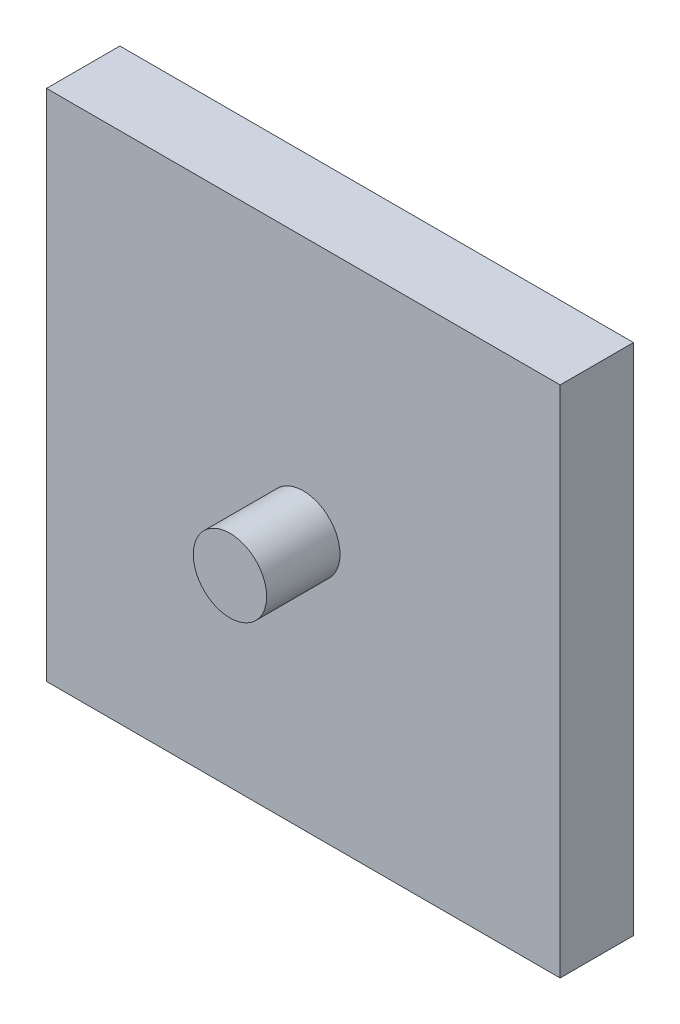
ISO-10303-21;
HEADER;
FILE_DESCRIPTION(('STEP AP214'),'2;1');
FILE_NAME('part.step','',(''),(''),'','','');
FILE_SCHEMA(('AUTOMOTIVE_DESIGN { 1 0 10303 214 1 1 1 1 }'));
ENDSEC;
DATA;
#1=APPLICATION_CONTEXT('core data for automotive mechanical design processes');
#2=APPLICATION_PROTOCOL_DEFINITION('international standard','automotive_design',2000,#1);
#3=PRODUCT_CONTEXT('',#1,'mechanical');
#4=PRODUCT('Part','Part','',(#3));
#5=PRODUCT_RELATED_PRODUCT_CATEGORY('part','',(#4));
#6=PRODUCT_DEFINITION_FORMATION('','',#4);
#7=PRODUCT_DEFINITION_CONTEXT('part definition',#1,'design');
#8=PRODUCT_DEFINITION('design','',#6,#7);
#9=PRODUCT_DEFINITION_SHAPE('','',#8);
#10=(LENGTH_UNIT() NAMED_UNIT(*) SI_UNIT(.MILLI.,.METRE.));
#11=(NAMED_UNIT(*) PLANE_ANGLE_UNIT() SI_UNIT($,.RADIAN.));
#12=(NAMED_UNIT(*) SI_UNIT($,.STERADIAN.) SOLID_ANGLE_UNIT());
#13=UNCERTAINTY_MEASURE_WITH_UNIT(LENGTH_MEASURE(1.E-05),#10,'distance_accuracy_value','');
#14=(GEOMETRIC_REPRESENTATION_CONTEXT(3) GLOBAL_UNCERTAINTY_ASSIGNED_CONTEXT((#13)) GLOBAL_UNIT_ASSIGNED_CONTEXT((#10,
#11,#12)) REPRESENTATION_CONTEXT('',''));
#15=CARTESIAN_POINT('',(0.,0.,0.));
#16=DIRECTION('',(0.,0.,1.));
#17=DIRECTION('',(1.,0.,0.));
#18=AXIS2_PLACEMENT_3D('',#15,#16,#17);
#19=CARTESIAN_POINT('',(-35.,-35.,10.));
#20=DIRECTION('',(1.,0.,0.));
#21=DIRECTION('',(0.,0.,-1.));
#22=AXIS2_PLACEMENT_3D('',#19,#20,#21);
#23=PLANE('',#22);
#24=DIRECTION('',(0.,-1.,0.));
#25=VECTOR('',#24,1.);
#26=CARTESIAN_POINT('',(-35.,-35.,0.));
#27=LINE('',#26,#25);
#28=CARTESIAN_POINT('',(-35.,35.,0.));
#29=VERTEX_POINT('',#28);
#30=CARTESIAN_POINT('',(-35.,-35.,0.));
#31=VERTEX_POINT('',#30);
#32=EDGE_CURVE('E95',#29,#31,#27,.T.);
#33=ORIENTED_EDGE('',*,*,#32,.T.);
#34=DIRECTION('',(0.,0.,-1.));
#35=VECTOR('',#34,1.);
#36=CARTESIAN_POINT('',(-35.,-35.,10.));
#37=LINE('',#36,#35);
#38=CARTESIAN_POINT('',(-35.,-35.,10.));
#39=VERTEX_POINT('',#38);
#40=EDGE_CURVE('E11',#39,#31,#37,.T.);
#41=ORIENTED_EDGE('',*,*,#40,.F.);
#42=DIRECTION('',(0.,-1.,0.));
#43=VECTOR('',#42,1.);
#44=CARTESIAN_POINT('',(-35.,-35.,10.));
#45=LINE('',#44,#43);
#46=CARTESIAN_POINT('',(-35.,35.,10.));
#47=VERTEX_POINT('',#46);
#48=EDGE_CURVE('E83',#47,#39,#45,.T.);
#49=ORIENTED_EDGE('',*,*,#48,.F.);
#50=DIRECTION('',(0.,0.,-1.));
#51=VECTOR('',#50,1.);
#52=CARTESIAN_POINT('',(-35.,35.,10.));
#53=LINE('',#52,#51);
#54=EDGE_CURVE('E91',#47,#29,#53,.T.);
#55=ORIENTED_EDGE('',*,*,#54,.T.);
#56=EDGE_LOOP('',(#33,#41,#49,#55));
#57=FACE_BOUND('',#56,.T.);
#58=ADVANCED_FACE('F32',(#57),#23,.F.);
#59=CARTESIAN_POINT('',(35.,-35.,10.));
#60=DIRECTION('',(0.,1.,0.));
#61=DIRECTION('',(-1.,0.,0.));
#62=AXIS2_PLACEMENT_3D('',#59,#60,#61);
#63=PLANE('',#62);
#64=DIRECTION('',(1.,0.,0.));
#65=VECTOR('',#64,1.);
#66=CARTESIAN_POINT('',(35.,-35.,0.));
#67=LINE('',#66,#65);
#68=CARTESIAN_POINT('',(35.,-35.,0.));
#69=VERTEX_POINT('',#68);
#70=EDGE_CURVE('E87',#31,#69,#67,.T.);
#71=ORIENTED_EDGE('',*,*,#70,.T.);
#72=DIRECTION('',(0.,0.,-1.));
#73=VECTOR('',#72,1.);
#74=CARTESIAN_POINT('',(35.,-35.,10.));
#75=LINE('',#74,#73);
#76=CARTESIAN_POINT('',(35.,-35.,10.));
#77=VERTEX_POINT('',#76);
#78=EDGE_CURVE('E40',#77,#69,#75,.T.);
#79=ORIENTED_EDGE('',*,*,#78,.F.);
#80=DIRECTION('',(1.,0.,0.));
#81=VECTOR('',#80,1.);
#82=CARTESIAN_POINT('',(35.,-35.,10.));
#83=LINE('',#82,#81);
#84=EDGE_CURVE('E78',#39,#77,#83,.T.);
#85=ORIENTED_EDGE('',*,*,#84,.F.);
#86=ORIENTED_EDGE('',*,*,#40,.T.);
#87=EDGE_LOOP('',(#71,#79,#85,#86));
#88=FACE_BOUND('',#87,.T.);
#89=ADVANCED_FACE('F86',(#88),#63,.F.);
#90=CARTESIAN_POINT('',(35.,-35.,10.));
#91=DIRECTION('',(-1.,0.,0.));
#92=DIRECTION('',(0.,0.,1.));
#93=AXIS2_PLACEMENT_3D('',#90,#91,#92);
#94=PLANE('',#93);
#95=DIRECTION('',(0.,1.,0.));
#96=VECTOR('',#95,1.);
#97=CARTESIAN_POINT('',(35.,-35.,0.));
#98=LINE('',#97,#96);
#99=CARTESIAN_POINT('',(35.,35.,0.));
#100=VERTEX_POINT('',#99);
#101=EDGE_CURVE('E65',#69,#100,#98,.T.);
#102=ORIENTED_EDGE('',*,*,#101,.T.);
#103=DIRECTION('',(0.,0.,-1.));
#104=VECTOR('',#103,1.);
#105=CARTESIAN_POINT('',(35.,35.,10.));
#106=LINE('',#105,#104);
#107=CARTESIAN_POINT('',(35.,35.,10.));
#108=VERTEX_POINT('',#107);
#109=EDGE_CURVE('E88',#108,#100,#106,.T.);
#110=ORIENTED_EDGE('',*,*,#109,.F.);
#111=DIRECTION('',(0.,1.,0.));
#112=VECTOR('',#111,1.);
#113=CARTESIAN_POINT('',(35.,-35.,10.));
#114=LINE('',#113,#112);
#115=EDGE_CURVE('E81',#77,#108,#114,.T.);
#116=ORIENTED_EDGE('',*,*,#115,.F.);
#117=ORIENTED_EDGE('',*,*,#78,.T.);
#118=EDGE_LOOP('',(#102,#110,#116,#117));
#119=FACE_BOUND('',#118,.T.);
#120=ADVANCED_FACE('F89',(#119),#94,.F.);
#121=CARTESIAN_POINT('',(35.,35.,10.));
#122=DIRECTION('',(0.,-1.,0.));
#123=DIRECTION('',(0.,0.,-1.));
#124=AXIS2_PLACEMENT_3D('',#121,#122,#123);
#125=PLANE('',#124);
#126=DIRECTION('',(-1.,0.,0.));
#127=VECTOR('',#126,1.);
#128=CARTESIAN_POINT('',(35.,35.,0.));
#129=LINE('',#128,#127);
#130=EDGE_CURVE('E71',#100,#29,#129,.T.);
#131=ORIENTED_EDGE('',*,*,#130,.T.);
#132=ORIENTED_EDGE('',*,*,#54,.F.);
#133=DIRECTION('',(-1.,0.,0.));
#134=VECTOR('',#133,1.);
#135=CARTESIAN_POINT('',(35.,35.,10.));
#136=LINE('',#135,#134);
#137=EDGE_CURVE('E48',#108,#47,#136,.T.);
#138=ORIENTED_EDGE('',*,*,#137,.F.);
#139=ORIENTED_EDGE('',*,*,#109,.T.);
#140=EDGE_LOOP('',(#131,#132,#138,#139));
#141=FACE_BOUND('',#140,.T.);
#142=ADVANCED_FACE('F103',(#141),#125,.F.);
#143=CARTESIAN_POINT('',(0.,0.,10.));
#144=DIRECTION('',(0.,0.,1.));
#145=DIRECTION('',(1.,0.,0.));
#146=AXIS2_PLACEMENT_3D('',#143,#144,#145);
#147=PLANE('',#146);
#148=CARTESIAN_POINT('',(0.,0.,10.));
#149=DIRECTION('',(0.,0.,1.));
#150=DIRECTION('',(1.,0.,0.));
#151=AXIS2_PLACEMENT_3D('',#148,#149,#150);
#152=CIRCLE('',#151,5.);
#153=CARTESIAN_POINT('',(5.,0.,10.));
#154=VERTEX_POINT('',#153);
#155=EDGE_CURVE('E109',#154,#154,#152,.T.);
#156=ORIENTED_EDGE('',*,*,#155,.F.);
#157=EDGE_LOOP('',(#156));
#158=FACE_BOUND('',#157,.T.);
#159=ORIENTED_EDGE('',*,*,#48,.T.);
#160=ORIENTED_EDGE('',*,*,#84,.T.);
#161=ORIENTED_EDGE('',*,*,#115,.T.);
#162=ORIENTED_EDGE('',*,*,#137,.T.);
#163=EDGE_LOOP('',(#159,#160,#161,#162));
#164=FACE_BOUND('',#163,.T.);
#165=ADVANCED_FACE('F79',(#158,#164),#147,.T.);
#166=CARTESIAN_POINT('',(0.,0.,0.));
#167=DIRECTION('',(0.,0.,1.));
#168=DIRECTION('',(1.,0.,0.));
#169=AXIS2_PLACEMENT_3D('',#166,#167,#168);
#170=PLANE('',#169);
#171=ORIENTED_EDGE('',*,*,#32,.F.);
#172=ORIENTED_EDGE('',*,*,#130,.F.);
#173=ORIENTED_EDGE('',*,*,#101,.F.);
#174=ORIENTED_EDGE('',*,*,#70,.F.);
#175=EDGE_LOOP('',(#171,#172,#173,#174));
#176=FACE_BOUND('',#175,.T.);
#177=ADVANCED_FACE('F106',(#176),#170,.F.);
#178=CARTESIAN_POINT('',(0.,0.,20.));
#179=DIRECTION('',(0.,0.,-1.));
#180=DIRECTION('',(-1.,0.,0.));
#181=AXIS2_PLACEMENT_3D('',#178,#179,#180);
#182=CYLINDRICAL_SURFACE('',#181,5.);
#183=CARTESIAN_POINT('',(0.,0.,20.));
#184=DIRECTION('',(0.,0.,1.));
#185=DIRECTION('',(1.,0.,0.));
#186=AXIS2_PLACEMENT_3D('',#183,#184,#185);
#187=CIRCLE('',#186,5.);
#188=CARTESIAN_POINT('',(5.,0.,20.));
#189=VERTEX_POINT('',#188);
#190=EDGE_CURVE('E98',#189,#189,#187,.T.);
#191=ORIENTED_EDGE('',*,*,#190,.F.);
#192=EDGE_LOOP('',(#191));
#193=FACE_BOUND('',#192,.T.);
#194=ORIENTED_EDGE('',*,*,#155,.T.);
#195=EDGE_LOOP('',(#194));
#196=FACE_BOUND('',#195,.T.);
#197=ADVANCED_FACE('F117',(#193,#196),#182,.T.);
#198=CARTESIAN_POINT('',(0.,0.,20.));
#199=DIRECTION('',(0.,0.,1.));
#200=DIRECTION('',(1.,0.,0.));
#201=AXIS2_PLACEMENT_3D('',#198,#199,#200);
#202=PLANE('',#201);
#203=ORIENTED_EDGE('',*,*,#190,.T.);
#204=EDGE_LOOP('',(#203));
#205=FACE_BOUND('',#204,.T.);
#206=ADVANCED_FACE('F115',(#205),#202,.T.);
#207=CLOSED_SHELL('',(#58,#89,#120,#142,#165,#177,#197,#206));
#208=MANIFOLD_SOLID_BREP('B2',#207);
#209=ADVANCED_BREP_SHAPE_REPRESENTATION('',(#18,#208),#14);
#210=SHAPE_DEFINITION_REPRESENTATION(#9,#209);
ENDSEC;
END-ISO-10303-21;
